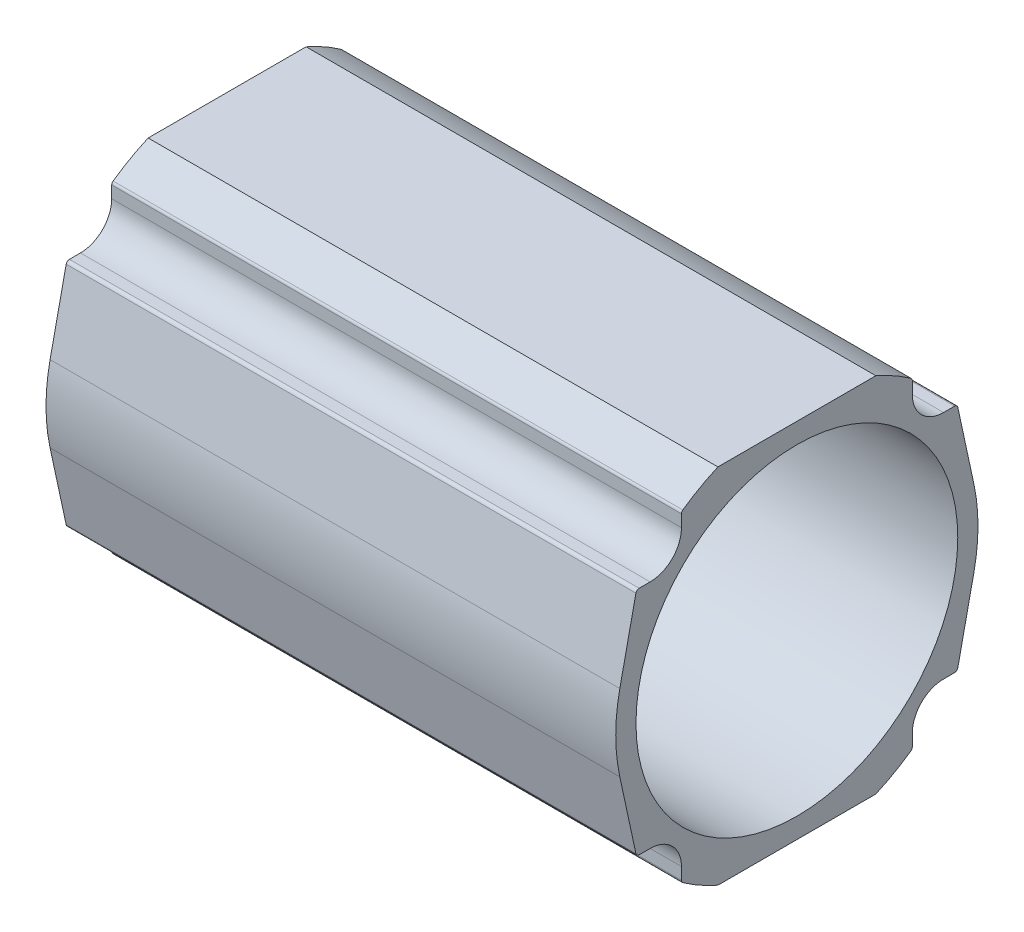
from build123d import *

# Parameters (mm, degrees)
EXTRUSION1_DEPTH        = 86.5
ESQUISSE2_R             = 24.428374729
ENL_V_MAT_EXTRU_1_DEPTH = 95.840655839


with BuildPart() as part:
    # Esquisse1 → Extrusion1 (new body)
    with BuildSketch(Plane(origin=(0, 0, 0), x_dir=(0, 0, -1), z_dir=(1, 0, 0))):
        with BuildLine():
            Line((-26.880457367, -5.804395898), (-24.435008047, -17.129398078))
            ThreePointArc((-24.435008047, -17.129398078), (-24.260304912, -17.412944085), (-23.946272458, -17.523863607))
            Line((-23.946272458, -17.523863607), (-22.273863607, -17.523863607))
            ThreePointArc((-22.273863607, -17.523863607), (-18.915106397, -18.915106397), (-17.523863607, -22.273863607))
            Line((-17.523863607, -22.273863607), (-17.523863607, -24.09228233))
            ThreePointArc((-17.523863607, -24.09228233), (-17.467862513, -24.32220617), (-17.31240372, -24.500626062))
            ThreePointArc((-17.31240372, -24.500626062), (-14.727545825, -26.136170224), (-11.989578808, -27.5))
            Line((-11.989578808, -27.5), (11.989578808, -27.5))
            ThreePointArc((11.989578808, -27.5), (14.727545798, -26.136170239), (17.312403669, -24.500626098))
            ThreePointArc((17.312403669, -24.500626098), (17.467862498, -24.322206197), (17.523863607, -24.09228233))
            Line((17.523863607, -24.09228233), (17.523863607, -22.273863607))
            ThreePointArc((17.523863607, -22.273863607), (18.915106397, -18.915106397), (22.273863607, -17.523863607))
            Line((22.273863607, -17.523863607), (23.946272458, -17.523863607))
            ThreePointArc((23.946272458, -17.523863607), (24.260304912, -17.412944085), (24.435008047, -17.129398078))
            Line((24.435008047, -17.129398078), (26.880457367, -5.804395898))
            ThreePointArc((26.880457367, -5.804395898), (27.5, 0), (26.880457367, 5.804395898))
            Line((26.880457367, 5.804395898), (24.435008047, 17.129398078))
            ThreePointArc((24.435008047, 17.129398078), (24.260304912, 17.412944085), (23.946272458, 17.523863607))
            Line((23.946272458, 17.523863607), (22.273863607, 17.523863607))
            ThreePointArc((22.273863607, 17.523863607), (18.915106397, 18.915106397), (17.523863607, 22.273863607))
            Line((17.523863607, 22.273863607), (17.523863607, 24.09228233))
            ThreePointArc((17.523863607, 24.09228233), (17.467862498, 24.322206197), (17.312403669, 24.500626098))
            ThreePointArc((17.312403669, 24.500626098), (14.727545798, 26.136170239), (11.989578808, 27.5))
            Line((11.989578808, 27.5), (-11.989578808, 27.5))
            ThreePointArc((-11.989578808, 27.5), (-14.727545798, 26.136170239), (-17.312403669, 24.500626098))
            ThreePointArc((-17.312403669, 24.500626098), (-17.467862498, 24.322206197), (-17.523863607, 24.09228233))
            Line((-17.523863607, 24.09228233), (-17.523863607, 22.273863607))
            ThreePointArc((-17.523863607, 22.273863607), (-18.915106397, 18.915106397), (-22.273863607, 17.523863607))
            Line((-22.273863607, 17.523863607), (-23.946272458, 17.523863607))
            ThreePointArc((-23.946272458, 17.523863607), (-24.260304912, 17.412944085), (-24.435008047, 17.129398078))
            Line((-24.435008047, 17.129398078), (-26.880457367, 5.804395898))
            ThreePointArc((-26.880457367, 5.804395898), (-27.5, 0), (-26.880457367, -5.804395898))
        make_face()
    extrude(amount=EXTRUSION1_DEPTH)

    # Esquisse2 → Enl_v. mat.-Extru.1 (cut, through all)
    with BuildSketch(Plane(origin=(86.5, 0, 0), x_dir=(0, 0, -1), z_dir=(1, 0, 0))):
        Circle(ESQUISSE2_R)
    extrude(amount=-ENL_V_MAT_EXTRU_1_DEPTH, mode=Mode.SUBTRACT)


solid = part.part
